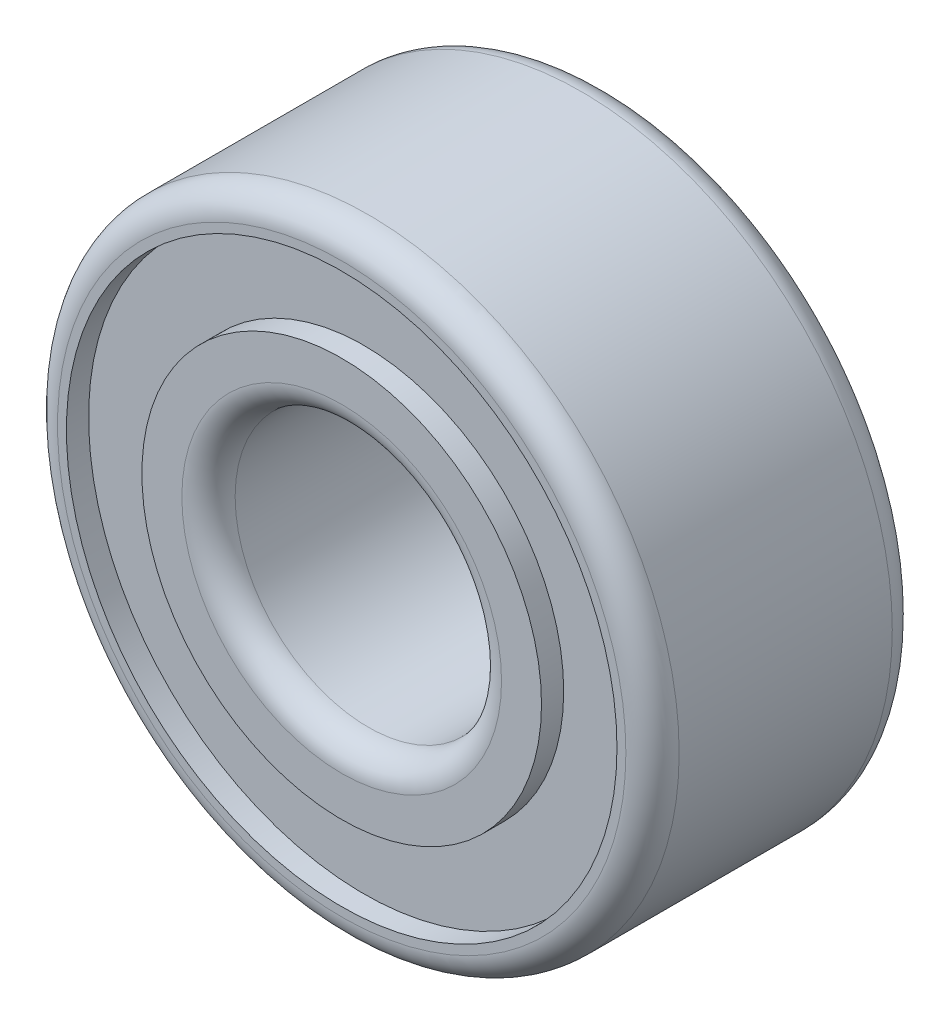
ISO-10303-21;
HEADER;
FILE_DESCRIPTION(('STEP AP214'),'2;1');
FILE_NAME('part.step','',(''),(''),'','','');
FILE_SCHEMA(('AUTOMOTIVE_DESIGN { 1 0 10303 214 1 1 1 1 }'));
ENDSEC;
DATA;
#1=APPLICATION_CONTEXT('core data for automotive mechanical design processes');
#2=APPLICATION_PROTOCOL_DEFINITION('international standard','automotive_design',2000,#1);
#3=PRODUCT_CONTEXT('',#1,'mechanical');
#4=PRODUCT('Part','Part','',(#3));
#5=PRODUCT_RELATED_PRODUCT_CATEGORY('part','',(#4));
#6=PRODUCT_DEFINITION_FORMATION('','',#4);
#7=PRODUCT_DEFINITION_CONTEXT('part definition',#1,'design');
#8=PRODUCT_DEFINITION('design','',#6,#7);
#9=PRODUCT_DEFINITION_SHAPE('','',#8);
#10=(LENGTH_UNIT() NAMED_UNIT(*) SI_UNIT(.MILLI.,.METRE.));
#11=(NAMED_UNIT(*) PLANE_ANGLE_UNIT() SI_UNIT($,.RADIAN.));
#12=(NAMED_UNIT(*) SI_UNIT($,.STERADIAN.) SOLID_ANGLE_UNIT());
#13=UNCERTAINTY_MEASURE_WITH_UNIT(LENGTH_MEASURE(1.E-05),#10,'distance_accuracy_value','');
#14=(GEOMETRIC_REPRESENTATION_CONTEXT(3) GLOBAL_UNCERTAINTY_ASSIGNED_CONTEXT((#13)) GLOBAL_UNIT_ASSIGNED_CONTEXT((#10,
#11,#12)) REPRESENTATION_CONTEXT('',''));
#15=CARTESIAN_POINT('',(0.,0.,0.));
#16=DIRECTION('',(0.,0.,1.));
#17=DIRECTION('',(1.,0.,0.));
#18=AXIS2_PLACEMENT_3D('',#15,#16,#17);
#19=CARTESIAN_POINT('',(0.,0.,-1.5));
#20=DIRECTION('',(0.,0.,1.));
#21=DIRECTION('',(1.,0.,0.));
#22=AXIS2_PLACEMENT_3D('',#19,#20,#21);
#23=PLANE('',#22);
#24=CARTESIAN_POINT('',(0.,0.,-1.5));
#25=DIRECTION('',(0.,0.,1.));
#26=DIRECTION('',(1.,0.,0.));
#27=AXIS2_PLACEMENT_3D('',#24,#25,#26);
#28=CIRCLE('',#27,3.2);
#29=CARTESIAN_POINT('',(3.2,0.,-1.5));
#30=VERTEX_POINT('',#29);
#31=EDGE_CURVE('E47',#30,#30,#28,.F.);
#32=ORIENTED_EDGE('',*,*,#31,.T.);
#33=EDGE_LOOP('',(#32));
#34=FACE_BOUND('',#33,.T.);
#35=CARTESIAN_POINT('',(0.,0.,-1.5));
#36=DIRECTION('',(0.,0.,1.));
#37=DIRECTION('',(1.,0.,0.));
#38=AXIS2_PLACEMENT_3D('',#35,#36,#37);
#39=CIRCLE('',#38,3.1);
#40=CARTESIAN_POINT('',(3.1,0.,-1.5));
#41=VERTEX_POINT('',#40);
#42=EDGE_CURVE('E74',#41,#41,#39,.T.);
#43=ORIENTED_EDGE('',*,*,#42,.T.);
#44=EDGE_LOOP('',(#43));
#45=FACE_BOUND('',#44,.T.);
#46=ADVANCED_FACE('F27',(#34,#45),#23,.F.);
#47=CARTESIAN_POINT('',(0.,0.,1.5));
#48=DIRECTION('',(0.,0.,1.));
#49=DIRECTION('',(1.,0.,0.));
#50=AXIS2_PLACEMENT_3D('',#47,#48,#49);
#51=PLANE('',#50);
#52=CARTESIAN_POINT('',(0.,0.,1.5));
#53=DIRECTION('',(0.,0.,1.));
#54=DIRECTION('',(1.,0.,0.));
#55=AXIS2_PLACEMENT_3D('',#52,#53,#54);
#56=CIRCLE('',#55,1.8);
#57=CARTESIAN_POINT('',(1.8,0.,1.5));
#58=VERTEX_POINT('',#57);
#59=EDGE_CURVE('E42',#58,#58,#56,.F.);
#60=ORIENTED_EDGE('',*,*,#59,.T.);
#61=EDGE_LOOP('',(#60));
#62=FACE_BOUND('',#61,.T.);
#63=CARTESIAN_POINT('',(0.,0.,1.5));
#64=DIRECTION('',(0.,0.,1.));
#65=DIRECTION('',(1.,0.,0.));
#66=AXIS2_PLACEMENT_3D('',#63,#64,#65);
#67=CIRCLE('',#66,2.25);
#68=CARTESIAN_POINT('',(2.25,0.,1.5));
#69=VERTEX_POINT('',#68);
#70=EDGE_CURVE('E68',#69,#69,#67,.T.);
#71=ORIENTED_EDGE('',*,*,#70,.T.);
#72=EDGE_LOOP('',(#71));
#73=FACE_BOUND('',#72,.T.);
#74=ADVANCED_FACE('F110',(#62,#73),#51,.T.);
#75=CARTESIAN_POINT('',(0.,0.,1.5));
#76=DIRECTION('',(0.,0.,1.));
#77=DIRECTION('',(1.,0.,0.));
#78=AXIS2_PLACEMENT_3D('',#75,#76,#77);
#79=CIRCLE('',#78,3.1);
#80=CARTESIAN_POINT('',(3.1,0.,1.5));
#81=VERTEX_POINT('',#80);
#82=EDGE_CURVE('E62',#81,#81,#79,.T.);
#83=ORIENTED_EDGE('',*,*,#82,.F.);
#84=EDGE_LOOP('',(#83));
#85=FACE_BOUND('',#84,.T.);
#86=CARTESIAN_POINT('',(0.,0.,1.5));
#87=DIRECTION('',(0.,0.,1.));
#88=DIRECTION('',(1.,0.,0.));
#89=AXIS2_PLACEMENT_3D('',#86,#87,#88);
#90=CIRCLE('',#89,3.2);
#91=CARTESIAN_POINT('',(3.2,0.,1.5));
#92=VERTEX_POINT('',#91);
#93=EDGE_CURVE('E38',#92,#92,#90,.T.);
#94=ORIENTED_EDGE('',*,*,#93,.T.);
#95=EDGE_LOOP('',(#94));
#96=FACE_BOUND('',#95,.T.);
#97=ADVANCED_FACE('F89',(#85,#96),#51,.T.);
#98=CARTESIAN_POINT('',(0.,0.,-1.5));
#99=DIRECTION('',(0.,0.,1.));
#100=DIRECTION('',(1.,0.,0.));
#101=AXIS2_PLACEMENT_3D('',#98,#99,#100);
#102=CIRCLE('',#101,2.25);
#103=CARTESIAN_POINT('',(2.25,0.,-1.5));
#104=VERTEX_POINT('',#103);
#105=EDGE_CURVE('E80',#104,#104,#102,.T.);
#106=ORIENTED_EDGE('',*,*,#105,.F.);
#107=EDGE_LOOP('',(#106));
#108=FACE_BOUND('',#107,.T.);
#109=CARTESIAN_POINT('',(0.,0.,-1.5));
#110=DIRECTION('',(0.,0.,1.));
#111=DIRECTION('',(1.,0.,0.));
#112=AXIS2_PLACEMENT_3D('',#109,#110,#111);
#113=CIRCLE('',#112,1.8);
#114=CARTESIAN_POINT('',(1.8,0.,-1.5));
#115=VERTEX_POINT('',#114);
#116=EDGE_CURVE('E50',#115,#115,#113,.T.);
#117=ORIENTED_EDGE('',*,*,#116,.T.);
#118=EDGE_LOOP('',(#117));
#119=FACE_BOUND('',#118,.T.);
#120=ADVANCED_FACE('F86',(#108,#119),#23,.F.);
#121=CARTESIAN_POINT('',(0.,0.,1.5));
#122=DIRECTION('',(0.,0.,-1.));
#123=DIRECTION('',(-1.,0.,0.));
#124=AXIS2_PLACEMENT_3D('',#121,#122,#123);
#125=CYLINDRICAL_SURFACE('',#124,3.5);
#126=CARTESIAN_POINT('',(0.,0.,-1.2));
#127=DIRECTION('',(0.,0.,1.));
#128=DIRECTION('',(1.,0.,0.));
#129=AXIS2_PLACEMENT_3D('',#126,#127,#128);
#130=CIRCLE('',#129,3.5);
#131=CARTESIAN_POINT('',(3.5,0.,-1.2));
#132=VERTEX_POINT('',#131);
#133=EDGE_CURVE('E53',#132,#132,#130,.T.);
#134=ORIENTED_EDGE('',*,*,#133,.T.);
#135=EDGE_LOOP('',(#134));
#136=FACE_BOUND('',#135,.T.);
#137=CARTESIAN_POINT('',(0.,0.,1.2));
#138=DIRECTION('',(0.,0.,1.));
#139=DIRECTION('',(1.,0.,0.));
#140=AXIS2_PLACEMENT_3D('',#137,#138,#139);
#141=CIRCLE('',#140,3.5);
#142=CARTESIAN_POINT('',(3.5,0.,1.2));
#143=VERTEX_POINT('',#142);
#144=EDGE_CURVE('E56',#143,#143,#141,.F.);
#145=ORIENTED_EDGE('',*,*,#144,.T.);
#146=EDGE_LOOP('',(#145));
#147=FACE_BOUND('',#146,.T.);
#148=ADVANCED_FACE('F29',(#136,#147),#125,.T.);
#149=CARTESIAN_POINT('',(0.,0.,1.5));
#150=DIRECTION('',(0.,0.,-1.));
#151=DIRECTION('',(-1.,0.,0.));
#152=AXIS2_PLACEMENT_3D('',#149,#150,#151);
#153=CYLINDRICAL_SURFACE('',#152,1.5);
#154=CARTESIAN_POINT('',(0.,0.,-1.2));
#155=DIRECTION('',(0.,0.,1.));
#156=DIRECTION('',(1.,0.,0.));
#157=AXIS2_PLACEMENT_3D('',#154,#155,#156);
#158=CIRCLE('',#157,1.5);
#159=CARTESIAN_POINT('',(1.5,0.,-1.2));
#160=VERTEX_POINT('',#159);
#161=EDGE_CURVE('E10',#160,#160,#158,.F.);
#162=ORIENTED_EDGE('',*,*,#161,.T.);
#163=EDGE_LOOP('',(#162));
#164=FACE_BOUND('',#163,.T.);
#165=CARTESIAN_POINT('',(0.,0.,1.2));
#166=DIRECTION('',(0.,0.,1.));
#167=DIRECTION('',(1.,0.,0.));
#168=AXIS2_PLACEMENT_3D('',#165,#166,#167);
#169=CIRCLE('',#168,1.5);
#170=CARTESIAN_POINT('',(1.5,0.,1.2));
#171=VERTEX_POINT('',#170);
#172=EDGE_CURVE('E34',#171,#171,#169,.T.);
#173=ORIENTED_EDGE('',*,*,#172,.T.);
#174=EDGE_LOOP('',(#173));
#175=FACE_BOUND('',#174,.T.);
#176=ADVANCED_FACE('F118',(#164,#175),#153,.F.);
#177=CARTESIAN_POINT('',(0.,0.,-1.2));
#178=DIRECTION('',(0.,0.,1.));
#179=DIRECTION('',(1.,0.,0.));
#180=AXIS2_PLACEMENT_3D('',#177,#178,#179);
#181=TOROIDAL_SURFACE('',#180,3.2,0.3);
#182=ORIENTED_EDGE('',*,*,#31,.F.);
#183=EDGE_LOOP('',(#182));
#184=FACE_BOUND('',#183,.T.);
#185=ORIENTED_EDGE('',*,*,#133,.F.);
#186=EDGE_LOOP('',(#185));
#187=FACE_BOUND('',#186,.T.);
#188=ADVANCED_FACE('F106',(#184,#187),#181,.T.);
#189=CARTESIAN_POINT('',(0.,0.,1.2));
#190=DIRECTION('',(0.,0.,1.));
#191=DIRECTION('',(1.,0.,0.));
#192=AXIS2_PLACEMENT_3D('',#189,#190,#191);
#193=TOROIDAL_SURFACE('',#192,3.2,0.3);
#194=ORIENTED_EDGE('',*,*,#144,.F.);
#195=EDGE_LOOP('',(#194));
#196=FACE_BOUND('',#195,.T.);
#197=ORIENTED_EDGE('',*,*,#93,.F.);
#198=EDGE_LOOP('',(#197));
#199=FACE_BOUND('',#198,.T.);
#200=ADVANCED_FACE('F96',(#196,#199),#193,.T.);
#201=CARTESIAN_POINT('',(0.,0.,-1.2));
#202=DIRECTION('',(0.,0.,1.));
#203=DIRECTION('',(1.,0.,0.));
#204=AXIS2_PLACEMENT_3D('',#201,#202,#203);
#205=TOROIDAL_SURFACE('',#204,1.8,0.3);
#206=ORIENTED_EDGE('',*,*,#161,.F.);
#207=EDGE_LOOP('',(#206));
#208=FACE_BOUND('',#207,.T.);
#209=ORIENTED_EDGE('',*,*,#116,.F.);
#210=EDGE_LOOP('',(#209));
#211=FACE_BOUND('',#210,.T.);
#212=ADVANCED_FACE('F93',(#208,#211),#205,.T.);
#213=CARTESIAN_POINT('',(0.,0.,1.2));
#214=DIRECTION('',(0.,0.,1.));
#215=DIRECTION('',(1.,0.,0.));
#216=AXIS2_PLACEMENT_3D('',#213,#214,#215);
#217=TOROIDAL_SURFACE('',#216,1.8,0.3);
#218=ORIENTED_EDGE('',*,*,#59,.F.);
#219=EDGE_LOOP('',(#218));
#220=FACE_BOUND('',#219,.T.);
#221=ORIENTED_EDGE('',*,*,#172,.F.);
#222=EDGE_LOOP('',(#221));
#223=FACE_BOUND('',#222,.T.);
#224=ADVANCED_FACE('F95',(#220,#223),#217,.T.);
#225=CARTESIAN_POINT('',(0.,0.,1.25));
#226=DIRECTION('',(0.,0.,1.));
#227=DIRECTION('',(1.,0.,0.));
#228=AXIS2_PLACEMENT_3D('',#225,#226,#227);
#229=CYLINDRICAL_SURFACE('',#228,3.1);
#230=CARTESIAN_POINT('',(0.,0.,1.25));
#231=DIRECTION('',(0.,0.,1.));
#232=DIRECTION('',(1.,0.,0.));
#233=AXIS2_PLACEMENT_3D('',#230,#231,#232);
#234=CIRCLE('',#233,3.1);
#235=CARTESIAN_POINT('',(3.1,0.,1.25));
#236=VERTEX_POINT('',#235);
#237=EDGE_CURVE('E59',#236,#236,#234,.T.);
#238=ORIENTED_EDGE('',*,*,#237,.F.);
#239=EDGE_LOOP('',(#238));
#240=FACE_BOUND('',#239,.T.);
#241=ORIENTED_EDGE('',*,*,#82,.T.);
#242=EDGE_LOOP('',(#241));
#243=FACE_BOUND('',#242,.T.);
#244=ADVANCED_FACE('F103',(#240,#243),#229,.F.);
#245=CARTESIAN_POINT('',(0.,0.,1.25));
#246=DIRECTION('',(0.,0.,1.));
#247=DIRECTION('',(1.,0.,0.));
#248=AXIS2_PLACEMENT_3D('',#245,#246,#247);
#249=PLANE('',#248);
#250=CARTESIAN_POINT('',(0.,0.,1.25));
#251=DIRECTION('',(0.,0.,1.));
#252=DIRECTION('',(1.,0.,0.));
#253=AXIS2_PLACEMENT_3D('',#250,#251,#252);
#254=CIRCLE('',#253,2.25);
#255=CARTESIAN_POINT('',(2.25,0.,1.25));
#256=VERTEX_POINT('',#255);
#257=EDGE_CURVE('E65',#256,#256,#254,.T.);
#258=ORIENTED_EDGE('',*,*,#257,.F.);
#259=EDGE_LOOP('',(#258));
#260=FACE_BOUND('',#259,.T.);
#261=ORIENTED_EDGE('',*,*,#237,.T.);
#262=EDGE_LOOP('',(#261));
#263=FACE_BOUND('',#262,.T.);
#264=ADVANCED_FACE('F130',(#260,#263),#249,.T.);
#265=CARTESIAN_POINT('',(0.,0.,1.25));
#266=DIRECTION('',(0.,0.,1.));
#267=DIRECTION('',(1.,0.,0.));
#268=AXIS2_PLACEMENT_3D('',#265,#266,#267);
#269=CYLINDRICAL_SURFACE('',#268,2.25);
#270=ORIENTED_EDGE('',*,*,#257,.T.);
#271=EDGE_LOOP('',(#270));
#272=FACE_BOUND('',#271,.T.);
#273=ORIENTED_EDGE('',*,*,#70,.F.);
#274=EDGE_LOOP('',(#273));
#275=FACE_BOUND('',#274,.T.);
#276=ADVANCED_FACE('F136',(#272,#275),#269,.T.);
#277=CARTESIAN_POINT('',(0.,0.,-1.25));
#278=DIRECTION('',(0.,0.,-1.));
#279=DIRECTION('',(1.,0.,0.));
#280=AXIS2_PLACEMENT_3D('',#277,#278,#279);
#281=PLANE('',#280);
#282=CARTESIAN_POINT('',(0.,0.,-1.25));
#283=DIRECTION('',(0.,0.,1.));
#284=DIRECTION('',(1.,0.,0.));
#285=AXIS2_PLACEMENT_3D('',#282,#283,#284);
#286=CIRCLE('',#285,3.1);
#287=CARTESIAN_POINT('',(3.1,0.,-1.25));
#288=VERTEX_POINT('',#287);
#289=EDGE_CURVE('E71',#288,#288,#286,.T.);
#290=ORIENTED_EDGE('',*,*,#289,.F.);
#291=EDGE_LOOP('',(#290));
#292=FACE_BOUND('',#291,.T.);
#293=CARTESIAN_POINT('',(0.,0.,-1.25));
#294=DIRECTION('',(0.,0.,1.));
#295=DIRECTION('',(1.,0.,0.));
#296=AXIS2_PLACEMENT_3D('',#293,#294,#295);
#297=CIRCLE('',#296,2.25);
#298=CARTESIAN_POINT('',(2.25,0.,-1.25));
#299=VERTEX_POINT('',#298);
#300=EDGE_CURVE('E77',#299,#299,#297,.T.);
#301=ORIENTED_EDGE('',*,*,#300,.T.);
#302=EDGE_LOOP('',(#301));
#303=FACE_BOUND('',#302,.T.);
#304=ADVANCED_FACE('F143',(#292,#303),#281,.T.);
#305=CARTESIAN_POINT('',(0.,0.,-1.25));
#306=DIRECTION('',(0.,0.,-1.));
#307=DIRECTION('',(-1.,0.,0.));
#308=AXIS2_PLACEMENT_3D('',#305,#306,#307);
#309=CYLINDRICAL_SURFACE('',#308,3.1);
#310=ORIENTED_EDGE('',*,*,#289,.T.);
#311=EDGE_LOOP('',(#310));
#312=FACE_BOUND('',#311,.T.);
#313=ORIENTED_EDGE('',*,*,#42,.F.);
#314=EDGE_LOOP('',(#313));
#315=FACE_BOUND('',#314,.T.);
#316=ADVANCED_FACE('F145',(#312,#315),#309,.F.);
#317=CARTESIAN_POINT('',(0.,0.,-1.25));
#318=DIRECTION('',(0.,0.,-1.));
#319=DIRECTION('',(-1.,0.,0.));
#320=AXIS2_PLACEMENT_3D('',#317,#318,#319);
#321=CYLINDRICAL_SURFACE('',#320,2.25);
#322=ORIENTED_EDGE('',*,*,#300,.F.);
#323=EDGE_LOOP('',(#322));
#324=FACE_BOUND('',#323,.T.);
#325=ORIENTED_EDGE('',*,*,#105,.T.);
#326=EDGE_LOOP('',(#325));
#327=FACE_BOUND('',#326,.T.);
#328=ADVANCED_FACE('F84',(#324,#327),#321,.T.);
#329=CLOSED_SHELL('',(#46,#74,#97,#120,#148,#176,#188,#200,#212,#224,#244,#264,#276,#304,#316,#328));
#330=MANIFOLD_SOLID_BREP('B2',#329);
#331=ADVANCED_BREP_SHAPE_REPRESENTATION('',(#18,#330),#14);
#332=SHAPE_DEFINITION_REPRESENTATION(#9,#331);
ENDSEC;
END-ISO-10303-21;
